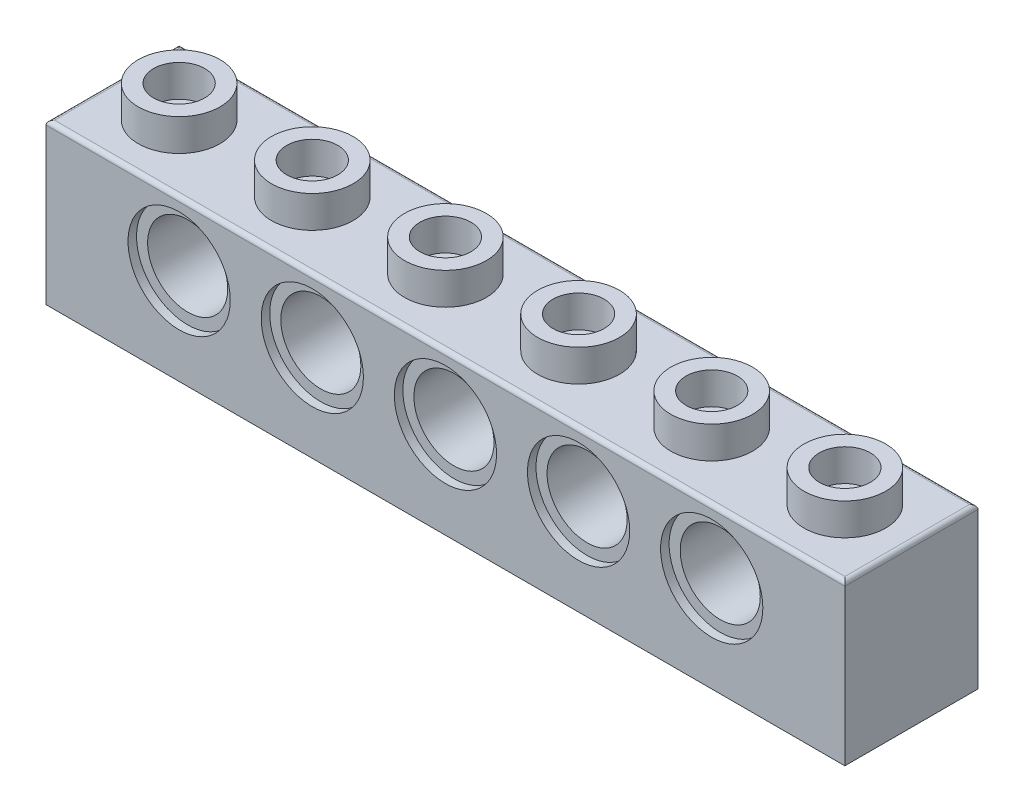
from build123d import *

# Parameters (mm, degrees)
SKETCH1_W                = 47.625
SKETCH1_H                = 7.9375
BASE_EXTRUDE_DEPTH       = 9.525
SKETCH2_R                = 2.4384
BOSS_EXTRUDE1_DEPTH      = 1.905
LPATTERN4_COUNT          = 6
LPATTERN4_PITCH          = 7.9375
SHELL1_T                 = -1.5875
SKETCH5_R                = 2.3876
CUT_EXTRUDE1_DEPTH       = 28.580499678
SKETCH6_R                = 3.048
CBORE1_DEPTH             = 0.508
CBORE2_START             = -0.762
SKETCH7_R                = 3.048
CBORE2_DEPTH             = 0.762
BOSS_EXTRUDE_THIN1_START = -5.842
SKETCH8_R                = 3.3876
SKETCH8_R_2              = 2.3876
BOSS_EXTRUDE_THIN1_DEPTH = 4.7625
LPATTERN7_COUNT          = 5
LPATTERN7_PITCH          = 7.9375
INSDOT2_REACH            = 28.71
INSDOT2_END_RADIUS       = 3.3876
SKETCH4_R                = 1.27
LPATTERN6_COUNT          = 5
LPATTERN6_PITCH          = 7.9375
CUT_EXTRUDE2_START       = -1.905
SKETCH10_R               = 1.524
CUT_EXTRUDE2_DEPTH       = 1.905
LPATTERN8_COUNT          = 6
LPATTERN8_PITCH          = 7.9375
FILLET1_R                = 0.254


with BuildPart() as part:
    # Sketch1 → Base-Extrude (new body)
    with BuildSketch(Plane(origin=(0, 0, 0), x_dir=(1, 0, 0), z_dir=(0, 1, 0))):
        Rectangle(SKETCH1_W, SKETCH1_H)
    extrude(amount=BASE_EXTRUDE_DEPTH)

    # Sketch2 → Boss-Extrude1 (add)
    with BuildSketch(Plane(origin=(0, 9.525, 0), x_dir=(-1, 0, 0), z_dir=(0, 1, 0))):
        with Locations(Location((19.84375, 0, 0), (0, 0, 270))):
            Circle(SKETCH2_R)
    boss_extrude1 = extrude(amount=BOSS_EXTRUDE1_DEPTH)

    # LPattern4: Boss-Extrude1 ×6
    with Locations(*[(i * LPATTERN4_PITCH, 0, 0) for i in range(1, LPATTERN4_COUNT)]):
        add(boss_extrude1)

    # Shell1
    shell1_openings = [part.faces().sort_by_distance(p)[0] for p in [
        (0, 0, 0),
    ]]
    offset(amount=SHELL1_T, openings=shell1_openings, kind=Kind.INTERSECTION)

    # Sketch5 → Cut-Extrude1 (cut, through all)
    with BuildSketch(Plane.XY.offset(3.96875)):
        with Locations((-15.875, 5.715)):
            Circle(SKETCH5_R)
    cut_extrude1 = extrude(amount=-CUT_EXTRUDE1_DEPTH, mode=Mode.SUBTRACT)

    # Sketch6 → cbore1 (cut)
    with BuildSketch(Plane.XY.offset(3.96875)):
        with Locations((-15.875, 5.715)):
            Circle(SKETCH6_R)
    cbore1 = extrude(amount=-CBORE1_DEPTH, mode=Mode.SUBTRACT)

    # Sketch7 → cbore2 (cut)
    with BuildSketch(Plane(origin=(0, 0, -3.96875), x_dir=(-1, 0, 0), z_dir=(0, 0, -1)).offset(CBORE2_START)):
        with Locations(Location((15.875, 5.715, 0), (0, 0, 180))):
            Circle(SKETCH7_R)
    cbore2 = extrude(amount=CBORE2_DEPTH, mode=Mode.SUBTRACT)

    # Sketch8 → Boss-Extrude-Thin1 (add)
    with BuildSketch(Plane.XY.offset(3.46075).offset(BOSS_EXTRUDE_THIN1_START)):
        with Locations((-15.875, 5.715)):
            Circle(SKETCH8_R)
        with Locations((-15.875, 5.715)):
            Circle(SKETCH8_R_2, mode=Mode.SUBTRACT)
    boss_extrude_thin1 = extrude(amount=BOSS_EXTRUDE_THIN1_DEPTH)

    # LPattern7: Cut-Extrude1, cbore1, cbore2, Boss-Extrude-Thin1 ×5
    with Locations(*[(i * LPATTERN7_PITCH, 0, 0) for i in range(1, LPATTERN7_COUNT)]):
        add(cut_extrude1, mode=Mode.SUBTRACT)
        add(cbore1, mode=Mode.SUBTRACT)
        add(cbore2, mode=Mode.SUBTRACT)
        add(boss_extrude_thin1)

    # InsDot2: up to this cylinder (the profile starts outside it)
    insdot2_end = Plane(origin=(15.875, 5.715, 0), z_dir=(0, 0, 1)) * Cylinder(INSDOT2_END_RADIUS, 65.1952, mode=Mode.PRIVATE)
    # Sketch4 → InsDot2 (add, up to the surface)
    with BuildSketch(Plane.XZ, mode=Mode.PRIVATE) as insdot2_sk1:
        with Locations(Location((15.875, 0, 0), (0, 0, 270))):
            Circle(SKETCH4_R)
    insdot2_tool1 = extrude(insdot2_sk1.sketch, amount=-INSDOT2_REACH, mode=Mode.PRIVATE) - insdot2_end
    insdot2 = insdot2_tool1.solids().sort_by_distance((15.875, 0, 0))[0]
    add(insdot2)

    # LPattern6: InsDot2 ×5
    with Locations(*[(-i * LPATTERN6_PITCH, 0, 0) for i in range(1, LPATTERN6_COUNT)]):
        add(insdot2)

    # Sketch10 → Cut-Extrude2 (cut)
    with BuildSketch(Plane(origin=(0, 11.43, 0), x_dir=(-1, 0, 0), z_dir=(0, 1, 0)).offset(CUT_EXTRUDE2_START)):
        with Locations(Location((19.84375, 0, 0), (0, 0, 90))):
            Circle(SKETCH10_R)
    cut_extrude2 = extrude(amount=CUT_EXTRUDE2_DEPTH, mode=Mode.SUBTRACT)

    # LPattern8: Cut-Extrude2 ×6
    with Locations(*[(i * LPATTERN8_PITCH, 0, 0) for i in range(1, LPATTERN8_COUNT)]):
        add(cut_extrude2, mode=Mode.SUBTRACT)

    # Fillet1
    fillet1_edges = [part.edges().sort_by_distance(p)[0] for p in [
        (23.8125, 9.525, 0),
        (0, 9.525, -3.96875),
        (-23.8125, 9.525, 0),
        (0, 9.525, 3.96875),
    ]]
    fillet(fillet1_edges, radius=FILLET1_R)


solid = part.part
